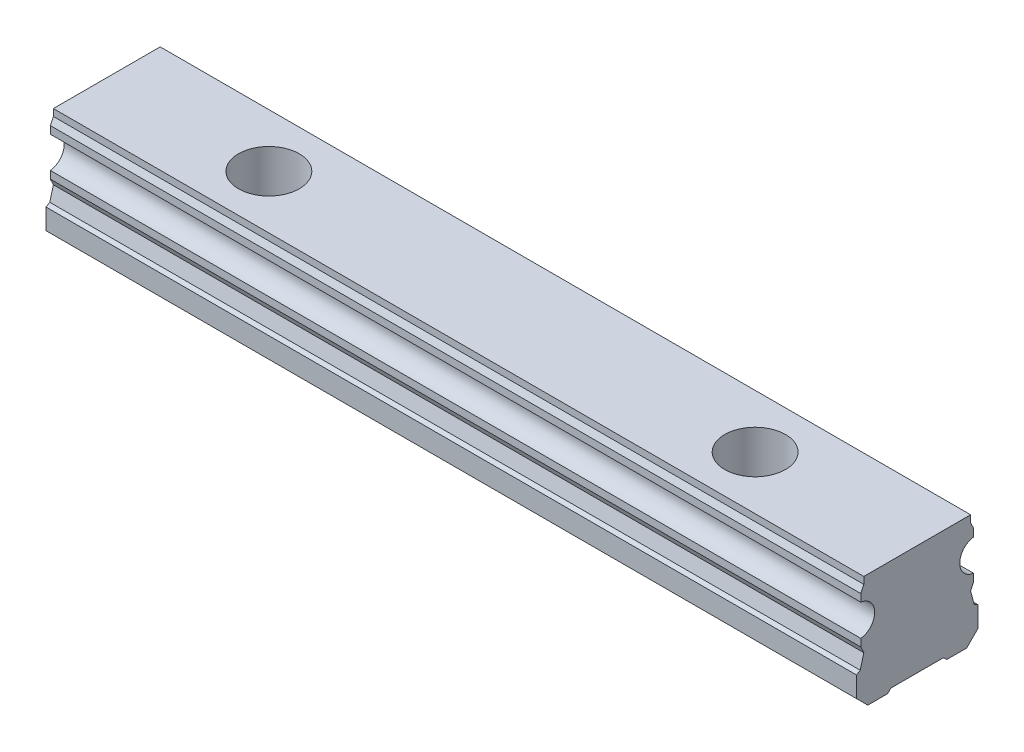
from build123d import *

# Parameters (mm, degrees)
BOSS_EXTRUDE1_DEPTH        = 100
SKETCH2_R                  = 3.75
SKETCH2_R_2                = 2.2
CUT_EXTRUDE1_DEPTH         = 6.2
SKETCH2_2_R                = 2.2
CUT_EXTRUDE2_DEPTH         = 102.253395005
LPATTERN1_COUNT            = 2
LPATTERN1_PITCH            = 60
SKETCH3_R                  = 2.5
SKETCH3_R_2                = 2.1
CUT_EXTRUDE3_DEPTH         = 7
SKETCH3_2_R                = 2.1
CUT_EXTRUDE4_DEPTH         = 9.5
CHAMFER1_SIZE              = 0.4
LPATTERN2_COUNT            = 2
LPATTERN2_PITCH            = 60
CHAMFER1_OF_LPATTERN2_SIZE = 0.4


with BuildPart() as part:
    # Sketch1 → Boss-Extrude1 (new body)
    with BuildSketch(Plane(origin=(0, 0, 0), x_dir=(0, 0, -1), z_dir=(1, 0, 0))):
        with BuildLine():
            Line((6.59, 14), (-6.59, 14))
            Line((-6.59, 14), (-6.59, 13.15))
            Line((-6.59, 13.15), (-6.96, 12.356532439))
            Line((-6.96, 12.356532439), (-6.96, 11.435174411))
            ThreePointArc((-6.96, 11.435174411), (-5.25, 9.5), (-6.96, 7.564825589))
            Line((-6.96, 7.564825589), (-6.96, 6.643467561))
            Line((-6.96, 6.643467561), (-6.59, 5.85))
            Line((-6.59, 5.85), (-7.032116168, 4.2))
            Line((-7.032116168, 4.2), (-7.5, 3.929867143))
            Line((-7.5, 3.929867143), (-7.5, 1.4))
            Line((-7.5, 1.4), (-6.1, 0))
            Line((-6.1, 0), (-3.65, 0))
            Line((-3.65, 0), (-3.25, 0.4))
            Line((-3.25, 0.4), (3.25, 0.4))
            Line((3.25, 0.4), (3.65, 0))
            Line((3.65, 0), (6.1, 0))
            Line((6.1, 0), (7.5, 1.4))
            Line((7.5, 1.4), (7.5, 3.929867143))
            Line((7.5, 3.929867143), (7.032116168, 4.2))
            Line((7.032116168, 4.2), (6.59, 5.85))
            Line((6.59, 5.85), (6.96, 6.643467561))
            Line((6.96, 6.643467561), (6.96, 7.564825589))
            ThreePointArc((6.96, 7.564825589), (5.25, 9.5), (6.96, 11.435174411))
            Line((6.96, 11.435174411), (6.96, 12.356532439))
            Line((6.96, 12.356532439), (6.59, 13.15))
            Line((6.59, 13.15), (6.59, 14))
        make_face()
    extrude(amount=BOSS_EXTRUDE1_DEPTH)

    # Sketch2 → Cut-Extrude1 (cut)
    with BuildSketch(Plane(origin=(0, 14, 0), x_dir=(1, 0, 0), z_dir=(0, 1, 0))):
        with Locations(Location((20, 0, 0), (0, 0, 270))):
            Circle(SKETCH2_R)
        with Locations(Location((20, 0, 0), (0, 0, 270))):
            Circle(SKETCH2_R_2, mode=Mode.SUBTRACT)
    cut_extrude1 = extrude(amount=-CUT_EXTRUDE1_DEPTH, mode=Mode.SUBTRACT)

    # Sketch2_2 → Cut-Extrude2 (cut, through all)
    with BuildSketch(Plane(origin=(0, 14, 0), x_dir=(1, 0, 0), z_dir=(0, 1, 0))):
        with Locations(Location((20, 0, 0), (0, 0, 270))):
            Circle(SKETCH2_2_R)
    cut_extrude2 = extrude(amount=-CUT_EXTRUDE2_DEPTH, mode=Mode.SUBTRACT)

    # LPattern1: Cut-Extrude1, Cut-Extrude2 ×2
    with Locations(*[(i * LPATTERN1_PITCH, 0, 0) for i in range(1, LPATTERN1_COUNT)]):
        add(cut_extrude1, mode=Mode.SUBTRACT)
        add(cut_extrude2, mode=Mode.SUBTRACT)

    # Sketch3 → Cut-Extrude3 (cut)
    with BuildSketch(Plane.XZ):
        with Locations(Location((10, 0, 0), (0, 0, 270))):
            Circle(SKETCH3_R)
        with Locations(Location((10, 0, 0), (0, 0, 270))):
            Circle(SKETCH3_R_2, mode=Mode.SUBTRACT)
    cut_extrude3 = extrude(amount=-CUT_EXTRUDE3_DEPTH, mode=Mode.SUBTRACT)

    # Sketch3_2 → Cut-Extrude4 (cut)
    with BuildSketch(Plane.XZ):
        with Locations(Location((10, 0, 0), (0, 0, 270))):
            Circle(SKETCH3_2_R)
    cut_extrude4 = extrude(amount=-CUT_EXTRUDE4_DEPTH, mode=Mode.SUBTRACT)

    # Cut-Extrude5 cone 1 section (on through the dimple's axis) → Cut-Extrude5 (revolve, cut)
    with BuildSketch(Plane(origin=(10, 9.5, 0), x_dir=(0, 0, -1), z_dir=(1, 0, 0))):
        Polygon((0, 0), (2.1, 0), (0, 1.212435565), align=None)
    revolve(axis=Axis((10, 9.5, 0), (0, 1, 0)), mode=Mode.SUBTRACT)

    # Chamfer1
    chamfer1_edges = [part.edges().sort_by_distance(p)[0] for p in [
        (10, 0.4, 2.5),
    ]]
    chamfer(chamfer1_edges, length=CHAMFER1_SIZE)

    # LPattern2: Cut-Extrude3, Cut-Extrude4 ×2
    with Locations(*[(i * LPATTERN2_PITCH, 0, 0) for i in range(1, LPATTERN2_COUNT)]):
        add(cut_extrude3, mode=Mode.SUBTRACT)
        add(cut_extrude4, mode=Mode.SUBTRACT)

    # Chamfer1 of LPattern2
    chamfer1_of_lpattern2_edges = [part.edges().sort_by_distance(p)[0] for p in [
        (70, 0.4, 2.5),
    ]]
    chamfer(chamfer1_of_lpattern2_edges, length=CHAMFER1_OF_LPATTERN2_SIZE)


solid = part.part
